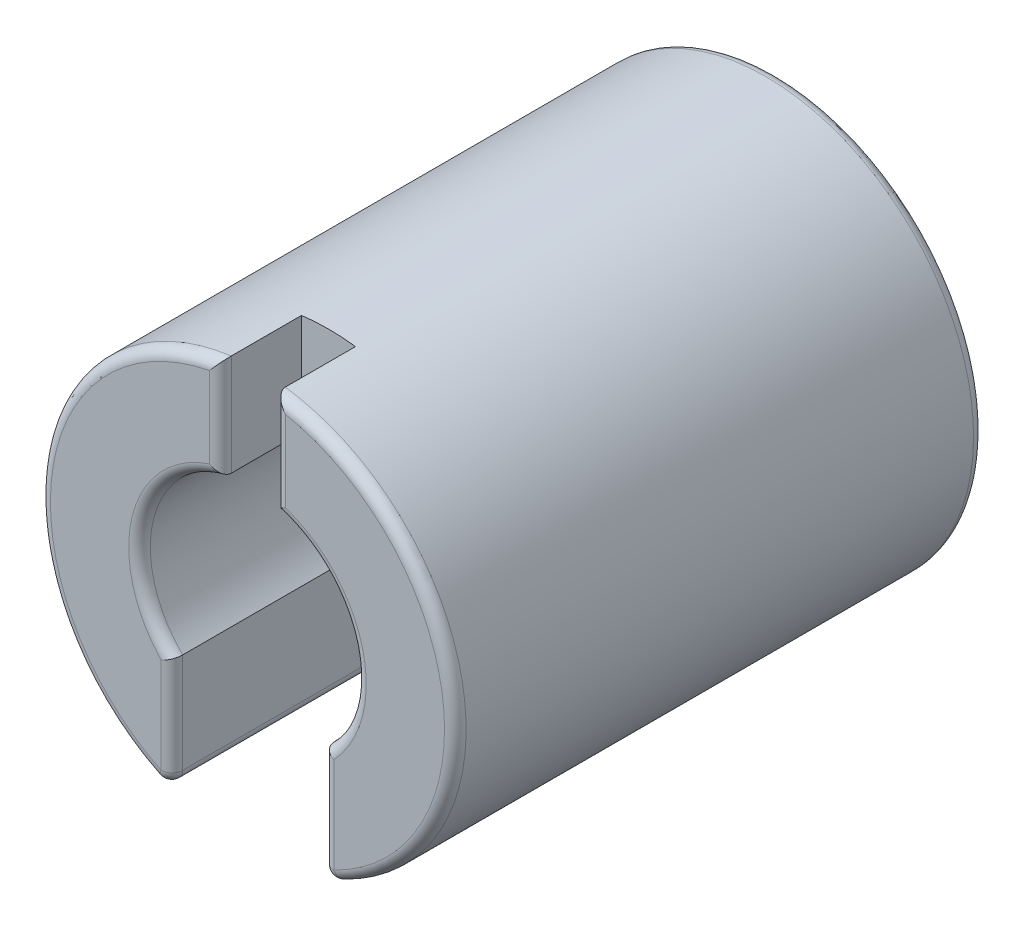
from build123d import *

# Parameters (mm, degrees)
EXTRUDE_1_DEPTH     = 9.8
CUT_EXTRUDE_START   = -1.5
CUT_EXTRUDE_1_DEPTH = 1.5
CUT_EXTRUDE_2_DEPTH = 1.5
CUT_EXTRUDE_3_DEPTH = 12.210932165
FILLET_1_R          = 0.2


with BuildPart() as part:
    # Sketch 1 → Extrude 1 (new body)
    with BuildSketch(Plane.XY):
        with BuildLine():
            Line((-1.4, -3.586432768), (-1.4, -1.428285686))
            ThreePointArc((-1.4, -1.428285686), (0, 2), (1.4, -1.428285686))
            Line((1.4, -1.428285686), (1.4, -3.586432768))
            ThreePointArc((1.4, -3.586432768), (0, 3.85), (-1.4, -3.586432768))
        make_face()
    extrude(amount=EXTRUDE_1_DEPTH)

    # Sketch 2 → Cut-Extrude 1 (cut)
    with BuildSketch(Plane.XY.offset(9.8).offset(CUT_EXTRUDE_START)):
        with BuildLine():
            Line((-0.5, 1.936491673), (-0.5, 3.817394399))
            ThreePointArc((-0.5, 3.817394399), (0, 3.85), (0.5, 3.817394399))
            Line((0.5, 3.817394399), (0.5, 1.936491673))
            ThreePointArc((0.5, 1.936491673), (0, 2), (-0.5, 1.936491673))
        make_face()
    extrude(amount=CUT_EXTRUDE_1_DEPTH, mode=Mode.SUBTRACT)

    # Sketch 3 → Cut-Extrude 2 (cut)
    with BuildSketch(Plane(origin=(0, 0, 0), x_dir=(-1, 0, 0), z_dir=(0, 0, -1))):
        with BuildLine():
            Line((-1.767766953, -1.767766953), (-2.474873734, -2.474873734))
            ThreePointArc((-2.474873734, -2.474873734), (0, 3.5), (2.474873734, -2.474873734))
            Line((2.474873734, -2.474873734), (1.767766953, -1.767766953))
            ThreePointArc((1.767766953, -1.767766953), (0, 2.5), (-1.767766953, -1.767766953))
        make_face()
    extrude(amount=-CUT_EXTRUDE_2_DEPTH, mode=Mode.SUBTRACT)

    # Sketch 4 → Cut-Extrude 3 (cut, through all)
    with BuildSketch(Plane(origin=(0, 0, 0), x_dir=(-1, 0, 0), z_dir=(0, 0, -1))):
        with BuildLine():
            Line((-0.5, 1.936491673), (-0.5, 2.244994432))
            ThreePointArc((-0.5, 2.244994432), (0, 2.3), (0.5, 2.244994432))
            Line((0.5, 2.244994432), (0.5, 1.936491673))
            ThreePointArc((0.5, 1.936491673), (0, 2), (-0.5, 1.936491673))
        make_face()
    extrude(amount=-CUT_EXTRUDE_3_DEPTH, mode=Mode.SUBTRACT)

    # Fillet 1
    fillet_1_edges = [part.edges().sort_by_distance(p)[0] for p in [
        (-1.932079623, 0.516786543, 9.8),
        (1.4, -2.507359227, 9.8),
        (-3.821866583, 0.464581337, 9.8),
        (1.932079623, 0.516786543, 9.8),
        (0.5, 2.876943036, 9.8),
        (-0.5, 2.876943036, 9.8),
        (3.821866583, 0.464581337, 9.8),
        (0, 3.85, 0),
        (-1.4, -2.507359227, 9.8),
        (1.4, -3.586432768, 4.9),
        (-1.4, -3.586432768, 4.9),
    ]]
    fillet(fillet_1_edges, radius=FILLET_1_R)


solid = part.part
